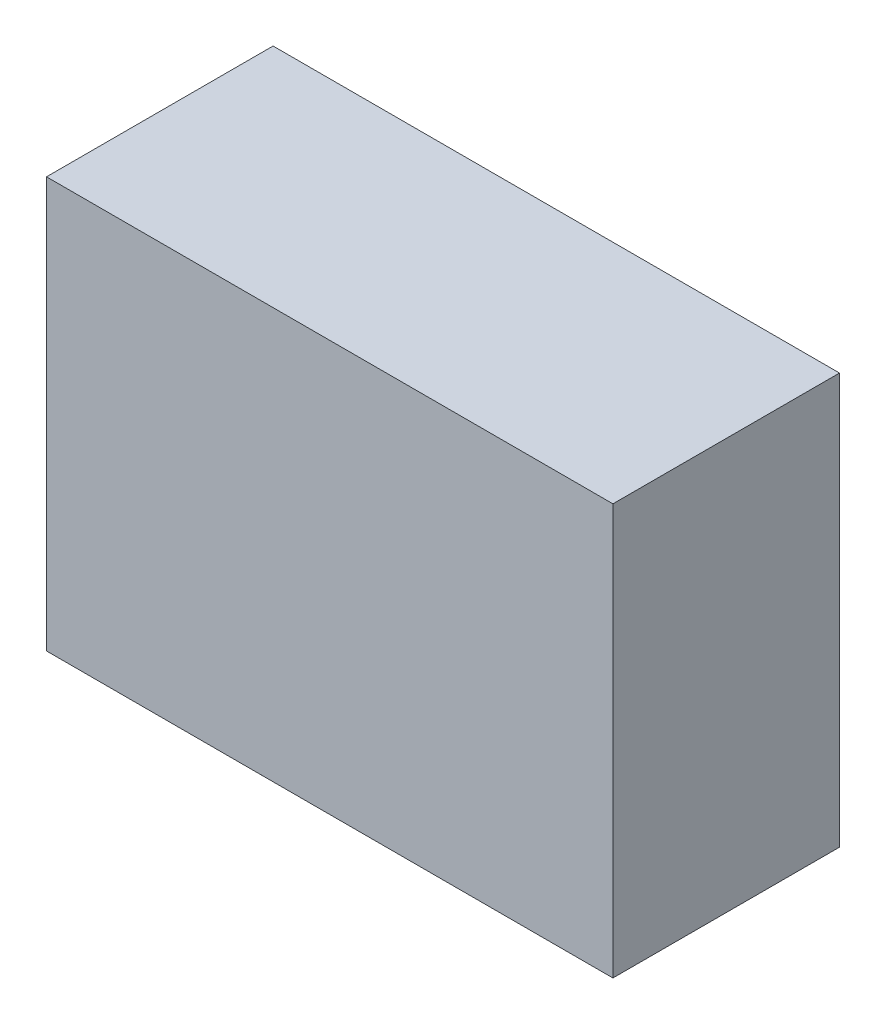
from build123d import *

# Parameters (mm, degrees)
ESQUISSE1_W      = 20
ESQUISSE1_H      = 14.5
EXTRUSION1_DEPTH = 8


with BuildPart() as part:
    # Esquisse1 → Extrusion1 (new body)
    with BuildSketch(Plane.XY):
        with Locations((10, 7.25)):
            Rectangle(ESQUISSE1_W, ESQUISSE1_H)
    extrude(amount=EXTRUSION1_DEPTH)


solid = part.part
